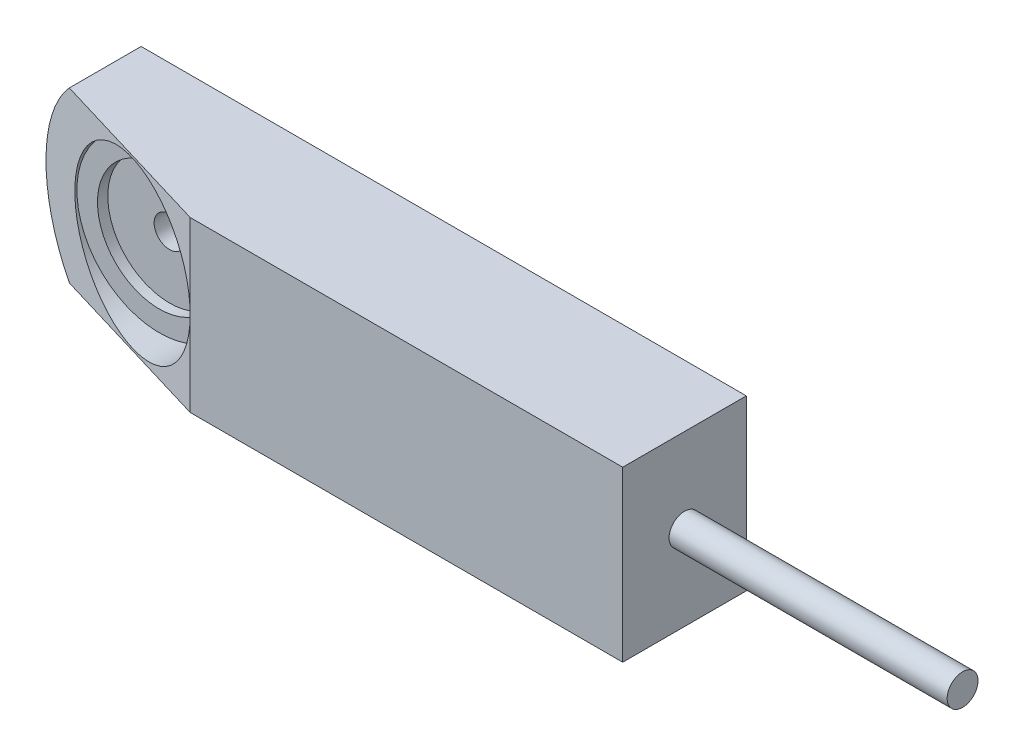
ISO-10303-21;
HEADER;
FILE_DESCRIPTION(('STEP AP214'),'2;1');
FILE_NAME('part.step','',(''),(''),'','','');
FILE_SCHEMA(('AUTOMOTIVE_DESIGN { 1 0 10303 214 1 1 1 1 }'));
ENDSEC;
DATA;
#1=APPLICATION_CONTEXT('core data for automotive mechanical design processes');
#2=APPLICATION_PROTOCOL_DEFINITION('international standard','automotive_design',2000,#1);
#3=PRODUCT_CONTEXT('',#1,'mechanical');
#4=PRODUCT('Part','Part','',(#3));
#5=PRODUCT_RELATED_PRODUCT_CATEGORY('part','',(#4));
#6=PRODUCT_DEFINITION_FORMATION('','',#4);
#7=PRODUCT_DEFINITION_CONTEXT('part definition',#1,'design');
#8=PRODUCT_DEFINITION('design','',#6,#7);
#9=PRODUCT_DEFINITION_SHAPE('','',#8);
#10=(LENGTH_UNIT() NAMED_UNIT(*) SI_UNIT(.MILLI.,.METRE.));
#11=(NAMED_UNIT(*) PLANE_ANGLE_UNIT() SI_UNIT($,.RADIAN.));
#12=(NAMED_UNIT(*) SI_UNIT($,.STERADIAN.) SOLID_ANGLE_UNIT());
#13=UNCERTAINTY_MEASURE_WITH_UNIT(LENGTH_MEASURE(1.E-05),#10,'distance_accuracy_value','');
#14=(GEOMETRIC_REPRESENTATION_CONTEXT(3) GLOBAL_UNCERTAINTY_ASSIGNED_CONTEXT((#13)) GLOBAL_UNIT_ASSIGNED_CONTEXT((#10,
#11,#12)) REPRESENTATION_CONTEXT('',''));
#15=CARTESIAN_POINT('',(0.,0.,0.));
#16=DIRECTION('',(0.,0.,1.));
#17=DIRECTION('',(1.,0.,0.));
#18=AXIS2_PLACEMENT_3D('',#15,#16,#17);
#19=CARTESIAN_POINT('',(-380.,-344.,189.460686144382));
#20=DIRECTION('',(-1.,0.,0.));
#21=DIRECTION('',(0.,0.,1.));
#22=AXIS2_PLACEMENT_3D('',#19,#20,#21);
#23=PLANE('',#22);
#24=CARTESIAN_POINT('',(-380.,0.,0.));
#25=DIRECTION('',(-1.,0.,0.));
#26=DIRECTION('',(0.,0.,1.));
#27=AXIS2_PLACEMENT_3D('',#24,#25,#26);
#28=CIRCLE('',#27,15.);
#29=CARTESIAN_POINT('',(-380.,0.,15.));
#30=VERTEX_POINT('',#29);
#31=EDGE_CURVE('E90',#30,#30,#28,.F.);
#32=ORIENTED_EDGE('',*,*,#31,.F.);
#33=EDGE_LOOP('',(#32));
#34=FACE_BOUND('',#33,.T.);
#35=DIRECTION('',(0.,1.,0.));
#36=VECTOR('',#35,1.);
#37=CARTESIAN_POINT('',(-380.,0.,-60.));
#38=LINE('',#37,#36);
#39=CARTESIAN_POINT('',(-380.,-82.,-60.));
#40=VERTEX_POINT('',#39);
#41=CARTESIAN_POINT('',(-380.,82.,-60.));
#42=VERTEX_POINT('',#41);
#43=EDGE_CURVE('E131',#40,#42,#38,.T.);
#44=ORIENTED_EDGE('',*,*,#43,.T.);
#45=DIRECTION('',(0.,0.,1.));
#46=VECTOR('',#45,1.);
#47=CARTESIAN_POINT('',(-380.,82.,189.460686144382));
#48=LINE('',#47,#46);
#49=CARTESIAN_POINT('',(-380.,82.,60.));
#50=VERTEX_POINT('',#49);
#51=EDGE_CURVE('E133',#42,#50,#48,.T.);
#52=ORIENTED_EDGE('',*,*,#51,.T.);
#53=DIRECTION('',(0.,1.,0.));
#54=VECTOR('',#53,1.);
#55=CARTESIAN_POINT('',(-380.,0.,60.));
#56=LINE('',#55,#54);
#57=CARTESIAN_POINT('',(-380.,-82.,60.));
#58=VERTEX_POINT('',#57);
#59=EDGE_CURVE('E138',#58,#50,#56,.T.);
#60=ORIENTED_EDGE('',*,*,#59,.F.);
#61=DIRECTION('',(0.,0.,-1.));
#62=VECTOR('',#61,1.);
#63=CARTESIAN_POINT('',(-380.,-82.,189.460686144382));
#64=LINE('',#63,#62);
#65=EDGE_CURVE('E135',#58,#40,#64,.T.);
#66=ORIENTED_EDGE('',*,*,#65,.T.);
#67=EDGE_LOOP('',(#44,#52,#60,#66));
#68=FACE_BOUND('',#67,.T.);
#69=ADVANCED_FACE('F37',(#34,#68),#23,.F.);
#70=CARTESIAN_POINT('',(0.,0.,60.));
#71=DIRECTION('',(0.,0.,-1.));
#72=DIRECTION('',(-1.,0.,0.));
#73=AXIS2_PLACEMENT_3D('',#70,#71,#72);
#74=PLANE('',#73);
#75=ORIENTED_EDGE('',*,*,#59,.T.);
#76=DIRECTION('',(-1.,0.,0.));
#77=VECTOR('',#76,1.);
#78=CARTESIAN_POINT('',(0.,82.,60.));
#79=LINE('',#78,#77);
#80=CARTESIAN_POINT('',(-800.,82.,60.));
#81=VERTEX_POINT('',#80);
#82=EDGE_CURVE('E154',#50,#81,#79,.T.);
#83=ORIENTED_EDGE('',*,*,#82,.T.);
#84=DIRECTION('',(0.,1.,0.));
#85=VECTOR('',#84,1.);
#86=CARTESIAN_POINT('',(-800.,-321.,60.));
#87=LINE('',#86,#85);
#88=CARTESIAN_POINT('',(-800.,0.,60.));
#89=VERTEX_POINT('',#88);
#90=EDGE_CURVE('E106',#89,#81,#87,.T.);
#91=ORIENTED_EDGE('',*,*,#90,.F.);
#92=CARTESIAN_POINT('',(-800.,-82.0000000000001,60.));
#93=VERTEX_POINT('',#92);
#94=EDGE_CURVE('E102',#93,#89,#87,.T.);
#95=ORIENTED_EDGE('',*,*,#94,.F.);
#96=DIRECTION('',(1.,0.,0.));
#97=VECTOR('',#96,1.);
#98=CARTESIAN_POINT('',(0.,-82.,60.));
#99=LINE('',#98,#97);
#100=EDGE_CURVE('E59',#93,#58,#99,.T.);
#101=ORIENTED_EDGE('',*,*,#100,.T.);
#102=EDGE_LOOP('',(#75,#83,#91,#95,#101));
#103=FACE_BOUND('',#102,.T.);
#104=ADVANCED_FACE('F39',(#103),#74,.F.);
#105=CARTESIAN_POINT('',(0.,0.,-60.));
#106=DIRECTION('',(0.,0.,-1.));
#107=DIRECTION('',(-1.,0.,0.));
#108=AXIS2_PLACEMENT_3D('',#105,#106,#107);
#109=PLANE('',#108);
#110=DIRECTION('',(-1.,0.,0.));
#111=VECTOR('',#110,1.);
#112=CARTESIAN_POINT('',(0.,82.,-60.));
#113=LINE('',#112,#111);
#114=CARTESIAN_POINT('',(-967.612784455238,82.,-60.0000000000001));
#115=VERTEX_POINT('',#114);
#116=EDGE_CURVE('E155',#42,#115,#113,.T.);
#117=ORIENTED_EDGE('',*,*,#116,.F.);
#118=ORIENTED_EDGE('',*,*,#43,.F.);
#119=DIRECTION('',(1.,0.,0.));
#120=VECTOR('',#119,1.);
#121=CARTESIAN_POINT('',(0.,-82.,-60.));
#122=LINE('',#121,#120);
#123=CARTESIAN_POINT('',(-967.612784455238,-82.0000000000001,-60.0000000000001));
#124=VERTEX_POINT('',#123);
#125=EDGE_CURVE('E98',#124,#40,#122,.T.);
#126=ORIENTED_EDGE('',*,*,#125,.F.);
#127=CARTESIAN_POINT('',(-880.,0.,-60.));
#128=DIRECTION('',(0.,0.,-1.));
#129=DIRECTION('',(-1.,0.,0.));
#130=AXIS2_PLACEMENT_3D('',#127,#128,#129);
#131=CIRCLE('',#130,120.);
#132=EDGE_CURVE('E97',#115,#124,#131,.F.);
#133=ORIENTED_EDGE('',*,*,#132,.F.);
#134=EDGE_LOOP('',(#117,#118,#126,#133));
#135=FACE_BOUND('',#134,.T.);
#136=CARTESIAN_POINT('',(-880.,0.,-60.));
#137=DIRECTION('',(0.,0.,-1.));
#138=DIRECTION('',(-1.,0.,0.));
#139=AXIS2_PLACEMENT_3D('',#136,#137,#138);
#140=CIRCLE('',#139,15.);
#141=CARTESIAN_POINT('',(-865.,0.,-60.));
#142=VERTEX_POINT('',#141);
#143=EDGE_CURVE('E144',#142,#142,#140,.T.);
#144=ORIENTED_EDGE('',*,*,#143,.F.);
#145=EDGE_LOOP('',(#144));
#146=FACE_BOUND('',#145,.T.);
#147=ADVANCED_FACE('F169',(#135,#146),#109,.T.);
#148=CARTESIAN_POINT('',(-880.,0.,-203.));
#149=DIRECTION('',(0.,0.,1.));
#150=DIRECTION('',(1.,0.,0.));
#151=AXIS2_PLACEMENT_3D('',#148,#149,#150);
#152=CYLINDRICAL_SURFACE('',#151,120.);
#153=CARTESIAN_POINT('',(-880.,0.,35.9999999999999));
#154=DIRECTION('',(0.287347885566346,0.,-0.957826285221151));
#155=DIRECTION('',(0.957826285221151,0.,0.287347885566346));
#156=AXIS2_PLACEMENT_3D('',#153,#154,#155);
#157=ELLIPSE('',#156,125.283678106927,120.);
#158=CARTESIAN_POINT('',(-967.612784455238,-82.0000000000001,9.71616466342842));
#159=VERTEX_POINT('',#158);
#160=CARTESIAN_POINT('',(-967.612784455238,82.,9.71616466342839));
#161=VERTEX_POINT('',#160);
#162=EDGE_CURVE('E95',#159,#161,#157,.T.);
#163=ORIENTED_EDGE('',*,*,#162,.T.);
#164=DIRECTION('',(0.,0.,1.));
#165=VECTOR('',#164,1.);
#166=CARTESIAN_POINT('',(-967.612784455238,82.,-203.));
#167=LINE('',#166,#165);
#168=EDGE_CURVE('E52',#161,#115,#167,.F.);
#169=ORIENTED_EDGE('',*,*,#168,.T.);
#170=ORIENTED_EDGE('',*,*,#132,.T.);
#171=DIRECTION('',(0.,0.,1.));
#172=VECTOR('',#171,1.);
#173=CARTESIAN_POINT('',(-967.612784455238,-82.0000000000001,-203.));
#174=LINE('',#173,#172);
#175=EDGE_CURVE('E85',#124,#159,#174,.T.);
#176=ORIENTED_EDGE('',*,*,#175,.T.);
#177=EDGE_LOOP('',(#163,#169,#170,#176));
#178=FACE_BOUND('',#177,.T.);
#179=ADVANCED_FACE('F94',(#178),#152,.T.);
#180=CARTESIAN_POINT('',(-800.,-321.,60.));
#181=DIRECTION('',(0.287347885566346,0.,-0.957826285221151));
#182=DIRECTION('',(-0.957826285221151,0.,-0.287347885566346));
#183=AXIS2_PLACEMENT_3D('',#180,#181,#182);
#184=PLANE('',#183);
#185=ORIENTED_EDGE('',*,*,#90,.T.);
#186=DIRECTION('',(-0.957826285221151,0.,-0.287347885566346));
#187=VECTOR('',#186,1.);
#188=CARTESIAN_POINT('',(-800.,82.,60.));
#189=LINE('',#188,#187);
#190=EDGE_CURVE('E11',#81,#161,#189,.T.);
#191=ORIENTED_EDGE('',*,*,#190,.T.);
#192=ORIENTED_EDGE('',*,*,#162,.F.);
#193=DIRECTION('',(0.957826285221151,0.,0.287347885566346));
#194=VECTOR('',#193,1.);
#195=CARTESIAN_POINT('',(-800.,-82.0000000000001,60.));
#196=LINE('',#195,#194);
#197=EDGE_CURVE('E45',#159,#93,#196,.T.);
#198=ORIENTED_EDGE('',*,*,#197,.T.);
#199=ORIENTED_EDGE('',*,*,#94,.T.);
#200=CARTESIAN_POINT('',(-880.,0.,35.9999999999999));
#201=DIRECTION('',(0.287347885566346,0.,-0.957826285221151));
#202=DIRECTION('',(-0.957826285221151,0.,-0.287347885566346));
#203=AXIS2_PLACEMENT_3D('',#200,#201,#202);
#204=ELLIPSE('',#203,83.5224520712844,80.);
#205=EDGE_CURVE('E104',#89,#89,#204,.T.);
#206=ORIENTED_EDGE('',*,*,#205,.T.);
#207=EDGE_LOOP('',(#185,#191,#192,#198,#199,#206));
#208=FACE_BOUND('',#207,.T.);
#209=ADVANCED_FACE('F101',(#208),#184,.F.);
#210=CARTESIAN_POINT('',(-880.,0.,332.));
#211=DIRECTION('',(0.,0.,-1.));
#212=DIRECTION('',(-1.,0.,0.));
#213=AXIS2_PLACEMENT_3D('',#210,#211,#212);
#214=CYLINDRICAL_SURFACE('',#213,80.);
#215=CARTESIAN_POINT('',(-880.,0.,10.));
#216=DIRECTION('',(0.,0.,1.));
#217=DIRECTION('',(1.,0.,0.));
#218=AXIS2_PLACEMENT_3D('',#215,#216,#217);
#219=CIRCLE('',#218,80.);
#220=CARTESIAN_POINT('',(-800.,0.,10.));
#221=VERTEX_POINT('',#220);
#222=EDGE_CURVE('E112',#221,#221,#219,.T.);
#223=ORIENTED_EDGE('',*,*,#222,.F.);
#224=EDGE_LOOP('',(#223));
#225=FACE_BOUND('',#224,.T.);
#226=ORIENTED_EDGE('',*,*,#205,.F.);
#227=EDGE_LOOP('',(#226));
#228=FACE_BOUND('',#227,.T.);
#229=ADVANCED_FACE('F177',(#225,#228),#214,.F.);
#230=CARTESIAN_POINT('',(-880.,0.,10.));
#231=DIRECTION('',(0.,0.,1.));
#232=DIRECTION('',(1.,0.,0.));
#233=AXIS2_PLACEMENT_3D('',#230,#231,#232);
#234=PLANE('',#233);
#235=ORIENTED_EDGE('',*,*,#222,.T.);
#236=EDGE_LOOP('',(#235));
#237=FACE_BOUND('',#236,.T.);
#238=CARTESIAN_POINT('',(-880.,0.,10.));
#239=DIRECTION('',(0.,0.,1.));
#240=DIRECTION('',(1.,0.,0.));
#241=AXIS2_PLACEMENT_3D('',#238,#239,#240);
#242=CIRCLE('',#241,60.);
#243=CARTESIAN_POINT('',(-820.,0.,10.));
#244=VERTEX_POINT('',#243);
#245=EDGE_CURVE('E141',#244,#244,#242,.T.);
#246=ORIENTED_EDGE('',*,*,#245,.F.);
#247=EDGE_LOOP('',(#246));
#248=FACE_BOUND('',#247,.T.);
#249=ADVANCED_FACE('F180',(#237,#248),#234,.T.);
#250=CARTESIAN_POINT('',(-880.,0.,10.));
#251=DIRECTION('',(0.,0.,-1.));
#252=DIRECTION('',(-1.,0.,0.));
#253=AXIS2_PLACEMENT_3D('',#250,#251,#252);
#254=CYLINDRICAL_SURFACE('',#253,60.);
#255=ORIENTED_EDGE('',*,*,#245,.T.);
#256=EDGE_LOOP('',(#255));
#257=FACE_BOUND('',#256,.T.);
#258=CARTESIAN_POINT('',(-880.,0.,0.));
#259=DIRECTION('',(0.,0.,1.));
#260=DIRECTION('',(1.,0.,0.));
#261=AXIS2_PLACEMENT_3D('',#258,#259,#260);
#262=CIRCLE('',#261,60.);
#263=CARTESIAN_POINT('',(-820.,0.,0.));
#264=VERTEX_POINT('',#263);
#265=EDGE_CURVE('E115',#264,#264,#262,.F.);
#266=ORIENTED_EDGE('',*,*,#265,.T.);
#267=EDGE_LOOP('',(#266));
#268=FACE_BOUND('',#267,.T.);
#269=ADVANCED_FACE('F185',(#257,#268),#254,.F.);
#270=CARTESIAN_POINT('',(-880.,0.,0.));
#271=DIRECTION('',(0.,0.,1.));
#272=DIRECTION('',(1.,0.,0.));
#273=AXIS2_PLACEMENT_3D('',#270,#271,#272);
#274=PLANE('',#273);
#275=CARTESIAN_POINT('',(-880.,0.,0.));
#276=DIRECTION('',(0.,0.,1.));
#277=DIRECTION('',(1.,0.,0.));
#278=AXIS2_PLACEMENT_3D('',#275,#276,#277);
#279=CIRCLE('',#278,15.);
#280=CARTESIAN_POINT('',(-865.,0.,0.));
#281=VERTEX_POINT('',#280);
#282=EDGE_CURVE('E157',#281,#281,#279,.T.);
#283=ORIENTED_EDGE('',*,*,#282,.F.);
#284=EDGE_LOOP('',(#283));
#285=FACE_BOUND('',#284,.T.);
#286=ORIENTED_EDGE('',*,*,#265,.F.);
#287=EDGE_LOOP('',(#286));
#288=FACE_BOUND('',#287,.T.);
#289=ADVANCED_FACE('F182',(#285,#288),#274,.T.);
#290=CARTESIAN_POINT('',(-380.,0.,0.));
#291=DIRECTION('',(-1.,0.,0.));
#292=DIRECTION('',(0.,0.,1.));
#293=AXIS2_PLACEMENT_3D('',#290,#291,#292);
#294=CYLINDRICAL_SURFACE('',#293,15.);
#295=ORIENTED_EDGE('',*,*,#31,.T.);
#296=EDGE_LOOP('',(#295));
#297=FACE_BOUND('',#296,.T.);
#298=CARTESIAN_POINT('',(-110.,0.,0.));
#299=DIRECTION('',(-1.,0.,0.));
#300=DIRECTION('',(0.,0.,1.));
#301=AXIS2_PLACEMENT_3D('',#298,#299,#300);
#302=CIRCLE('',#301,15.);
#303=CARTESIAN_POINT('',(-110.,0.,15.));
#304=VERTEX_POINT('',#303);
#305=EDGE_CURVE('E139',#304,#304,#302,.T.);
#306=ORIENTED_EDGE('',*,*,#305,.T.);
#307=EDGE_LOOP('',(#306));
#308=FACE_BOUND('',#307,.T.);
#309=ADVANCED_FACE('F121',(#297,#308),#294,.T.);
#310=CARTESIAN_POINT('',(-110.,0.,0.));
#311=DIRECTION('',(-1.,0.,0.));
#312=DIRECTION('',(0.,0.,1.));
#313=AXIS2_PLACEMENT_3D('',#310,#311,#312);
#314=PLANE('',#313);
#315=ORIENTED_EDGE('',*,*,#305,.F.);
#316=EDGE_LOOP('',(#315));
#317=FACE_BOUND('',#316,.T.);
#318=ADVANCED_FACE('F196',(#317),#314,.F.);
#319=CARTESIAN_POINT('',(-880.,0.,-399.));
#320=DIRECTION('',(0.,0.,1.));
#321=DIRECTION('',(1.,0.,0.));
#322=AXIS2_PLACEMENT_3D('',#319,#320,#321);
#323=CYLINDRICAL_SURFACE('',#322,15.);
#324=CARTESIAN_POINT('',(-865.,0.,-60.));
#325=CARTESIAN_POINT('',(-865.,0.,-59.375));
#326=CARTESIAN_POINT('',(-865.,0.,-58.75));
#327=CARTESIAN_POINT('',(-865.,0.,-57.5));
#328=CARTESIAN_POINT('',(-865.,0.,-56.875));
#329=CARTESIAN_POINT('',(-865.,0.,-55.625));
#330=CARTESIAN_POINT('',(-865.,0.,-55.));
#331=CARTESIAN_POINT('',(-865.,0.,-53.75));
#332=CARTESIAN_POINT('',(-865.,0.,-53.125));
#333=CARTESIAN_POINT('',(-865.,0.,-51.875));
#334=CARTESIAN_POINT('',(-865.,0.,-51.25));
#335=CARTESIAN_POINT('',(-865.,0.,-50.));
#336=CARTESIAN_POINT('',(-865.,0.,-49.375));
#337=CARTESIAN_POINT('',(-865.,0.,-48.125));
#338=CARTESIAN_POINT('',(-865.,0.,-47.5));
#339=CARTESIAN_POINT('',(-865.,0.,-46.25));
#340=CARTESIAN_POINT('',(-865.,0.,-45.625));
#341=CARTESIAN_POINT('',(-865.,0.,-44.375));
#342=CARTESIAN_POINT('',(-865.,0.,-43.75));
#343=CARTESIAN_POINT('',(-865.,0.,-42.5));
#344=CARTESIAN_POINT('',(-865.,0.,-41.875));
#345=CARTESIAN_POINT('',(-865.,0.,-40.625));
#346=CARTESIAN_POINT('',(-865.,0.,-40.));
#347=CARTESIAN_POINT('',(-865.,0.,-38.75));
#348=CARTESIAN_POINT('',(-865.,0.,-38.125));
#349=CARTESIAN_POINT('',(-865.,0.,-36.875));
#350=CARTESIAN_POINT('',(-865.,0.,-36.25));
#351=CARTESIAN_POINT('',(-865.,0.,-35.));
#352=CARTESIAN_POINT('',(-865.,0.,-34.375));
#353=CARTESIAN_POINT('',(-865.,0.,-33.125));
#354=CARTESIAN_POINT('',(-865.,0.,-32.5));
#355=CARTESIAN_POINT('',(-865.,0.,-31.25));
#356=CARTESIAN_POINT('',(-865.,0.,-30.625));
#357=CARTESIAN_POINT('',(-865.,0.,-29.375));
#358=CARTESIAN_POINT('',(-865.,0.,-28.75));
#359=CARTESIAN_POINT('',(-865.,0.,-27.5));
#360=CARTESIAN_POINT('',(-865.,0.,-26.875));
#361=CARTESIAN_POINT('',(-865.,0.,-25.625));
#362=CARTESIAN_POINT('',(-865.,0.,-25.));
#363=CARTESIAN_POINT('',(-865.,0.,-23.75));
#364=CARTESIAN_POINT('',(-865.,0.,-23.125));
#365=CARTESIAN_POINT('',(-865.,0.,-21.875));
#366=CARTESIAN_POINT('',(-865.,0.,-21.25));
#367=CARTESIAN_POINT('',(-865.,0.,-20.0000000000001));
#368=CARTESIAN_POINT('',(-865.,0.,-19.375));
#369=CARTESIAN_POINT('',(-865.,0.,-18.125));
#370=CARTESIAN_POINT('',(-865.,0.,-17.5));
#371=CARTESIAN_POINT('',(-865.,0.,-16.25));
#372=CARTESIAN_POINT('',(-865.,0.,-15.6250000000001));
#373=CARTESIAN_POINT('',(-865.,0.,-14.3750000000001));
#374=CARTESIAN_POINT('',(-865.,0.,-13.7500000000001));
#375=CARTESIAN_POINT('',(-865.,0.,-12.5));
#376=CARTESIAN_POINT('',(-865.,0.,-11.875));
#377=CARTESIAN_POINT('',(-865.,0.,-10.6250000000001));
#378=CARTESIAN_POINT('',(-865.,0.,-10.0000000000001));
#379=CARTESIAN_POINT('',(-865.,0.,-8.75000000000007));
#380=CARTESIAN_POINT('',(-865.,0.,-8.12500000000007));
#381=CARTESIAN_POINT('',(-865.,0.,-6.87500000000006));
#382=CARTESIAN_POINT('',(-865.,0.,-6.25000000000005));
#383=CARTESIAN_POINT('',(-865.,0.,-5.00000000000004));
#384=CARTESIAN_POINT('',(-865.,0.,-4.37500000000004));
#385=CARTESIAN_POINT('',(-865.,0.,-3.12500000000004));
#386=CARTESIAN_POINT('',(-865.,0.,-2.50000000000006));
#387=CARTESIAN_POINT('',(-865.,0.,-1.25000000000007));
#388=CARTESIAN_POINT('',(-865.,0.,-0.625000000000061));
#389=CARTESIAN_POINT('',(-865.,0.,0.));
#390=B_SPLINE_CURVE_WITH_KNOTS('',3,(#324,#325,#326,#327,#328,#329,#330,#331,#332,#333,#334,
#335,#336,#337,#338,#339,#340,#341,#342,#343,#344,#345,#346,#347,#348,#349,#350,#351,#352,#353,
#354,#355,#356,#357,#358,#359,#360,#361,#362,#363,#364,#365,#366,#367,#368,#369,#370,#371,#372,
#373,#374,#375,#376,#377,#378,#379,#380,#381,#382,#383,#384,#385,#386,#387,#388,#389),
.UNSPECIFIED.,.F.,.F.,(4,2,2,2,2,2,2,2,2,2,2,2,2,2,2,2,2,2,2,2,2,2,2,2,2,2,2,2,2,2,2,2,4),(0.,
1.87500000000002,3.74999999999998,5.62499999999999,7.50000000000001,9.37499999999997,11.25,
13.125,15.,16.875,18.75,20.625,22.5,24.375,26.25,28.125,30.,31.875,33.7499999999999,35.625,37.5,
39.3749999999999,41.25,43.125,44.9999999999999,46.8749999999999,48.75,50.6249999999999,
52.4999999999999,54.375,56.25,58.1249999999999,59.9999999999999),.UNSPECIFIED.);
#391=EDGE_CURVE('BSEAM166',#142,#281,#390,.T.);
#392=ORIENTED_EDGE('',*,*,#143,.T.);
#393=ORIENTED_EDGE('',*,*,#282,.T.);
#394=ORIENTED_EDGE('',*,*,#391,.T.);
#395=ORIENTED_EDGE('',*,*,#391,.F.);
#396=EDGE_LOOP('',(#392,#394,#393,#395));
#397=FACE_BOUND('',#396,.T.);
#398=ADVANCED_FACE('F166',(#397),#323,.F.);
#399=CARTESIAN_POINT('',(-359.283159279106,-82.,-145.));
#400=DIRECTION('',(0.,1.,0.));
#401=DIRECTION('',(-1.,0.,0.));
#402=AXIS2_PLACEMENT_3D('',#399,#400,#401);
#403=PLANE('',#402);
#404=ORIENTED_EDGE('',*,*,#100,.F.);
#405=ORIENTED_EDGE('',*,*,#197,.F.);
#406=ORIENTED_EDGE('',*,*,#175,.F.);
#407=ORIENTED_EDGE('',*,*,#125,.T.);
#408=ORIENTED_EDGE('',*,*,#65,.F.);
#409=EDGE_LOOP('',(#404,#405,#406,#407,#408));
#410=FACE_BOUND('',#409,.T.);
#411=ADVANCED_FACE('F84',(#410),#403,.F.);
#412=CARTESIAN_POINT('',(-1095.47550323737,82.,-145.));
#413=DIRECTION('',(0.,-1.,0.));
#414=DIRECTION('',(0.,0.,-1.));
#415=AXIS2_PLACEMENT_3D('',#412,#413,#414);
#416=PLANE('',#415);
#417=ORIENTED_EDGE('',*,*,#116,.T.);
#418=ORIENTED_EDGE('',*,*,#168,.F.);
#419=ORIENTED_EDGE('',*,*,#190,.F.);
#420=ORIENTED_EDGE('',*,*,#82,.F.);
#421=ORIENTED_EDGE('',*,*,#51,.F.);
#422=EDGE_LOOP('',(#417,#418,#419,#420,#421));
#423=FACE_BOUND('',#422,.T.);
#424=ADVANCED_FACE('F204',(#423),#416,.F.);
#425=CLOSED_SHELL('',(#69,#104,#147,#179,#209,#229,#249,#269,#289,#309,#318,#398,#411,#424));
#426=MANIFOLD_SOLID_BREP('B2',#425);
#427=ADVANCED_BREP_SHAPE_REPRESENTATION('',(#18,#426),#14);
#428=SHAPE_DEFINITION_REPRESENTATION(#9,#427);
ENDSEC;
END-ISO-10303-21;
